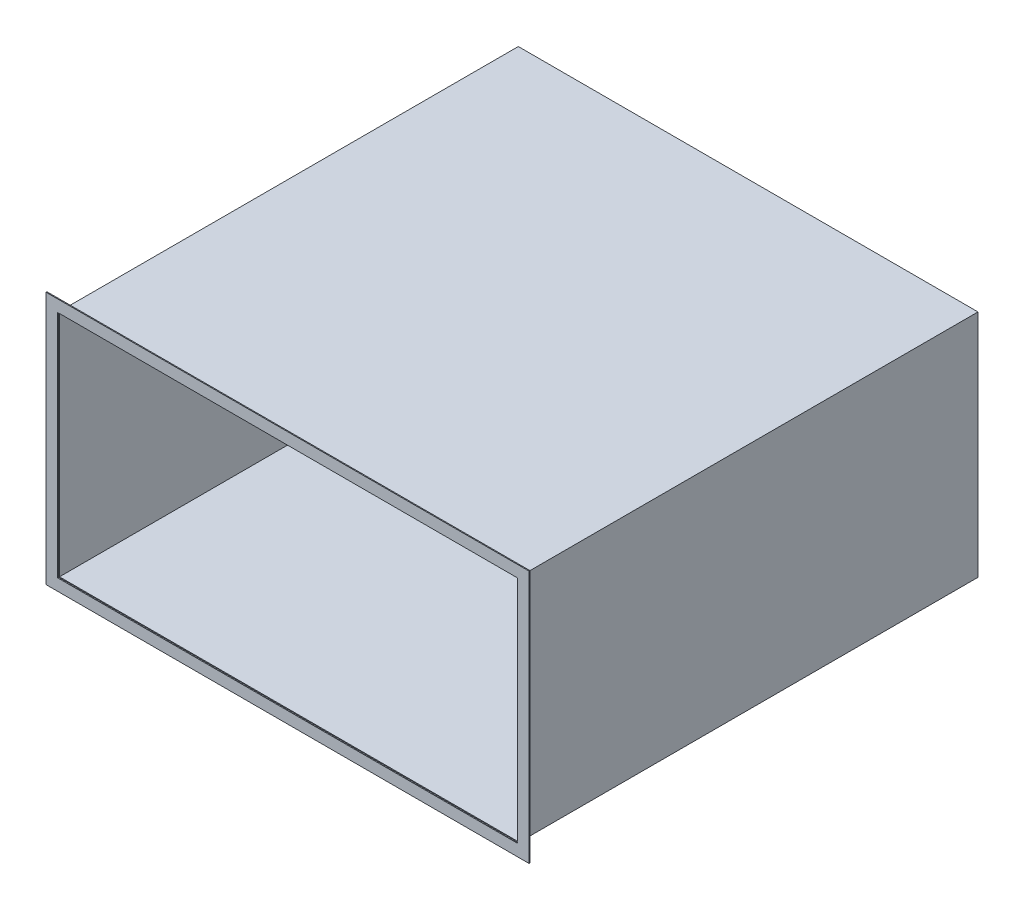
from build123d import *

# Parameters (mm, degrees)
SKETCH1_W           = 1000
SKETCH1_H           = 500
SKETCH1_W_2         = 996
SKETCH1_H_2         = 496
EXTRUDE_2_DEPTH     = 1000
SKETCH2_W           = 1050.8
SKETCH2_H           = 550.8
SKETCH2_W_2         = 1000
SKETCH2_H_2         = 500
BOSS_EXTRUDE1_DEPTH = 2


with BuildPart() as part:
    # Sketch1 → Extrude 2 (new body)
    with BuildSketch(Plane.XY):
        Rectangle(SKETCH1_W, SKETCH1_H)
        Rectangle(SKETCH1_W_2, SKETCH1_H_2, mode=Mode.SUBTRACT)
    extrude(amount=EXTRUDE_2_DEPTH)


with BuildPart() as body_2:
    # Sketch2 → Boss-Extrude1 (new body)
    with BuildSketch(Plane.XY.offset(1000)):
        Rectangle(SKETCH2_W, SKETCH2_H)
        Rectangle(SKETCH2_W_2, SKETCH2_H_2, mode=Mode.SUBTRACT)
    extrude(amount=BOSS_EXTRUDE1_DEPTH)


solid = Compound([part.part, body_2.part])
